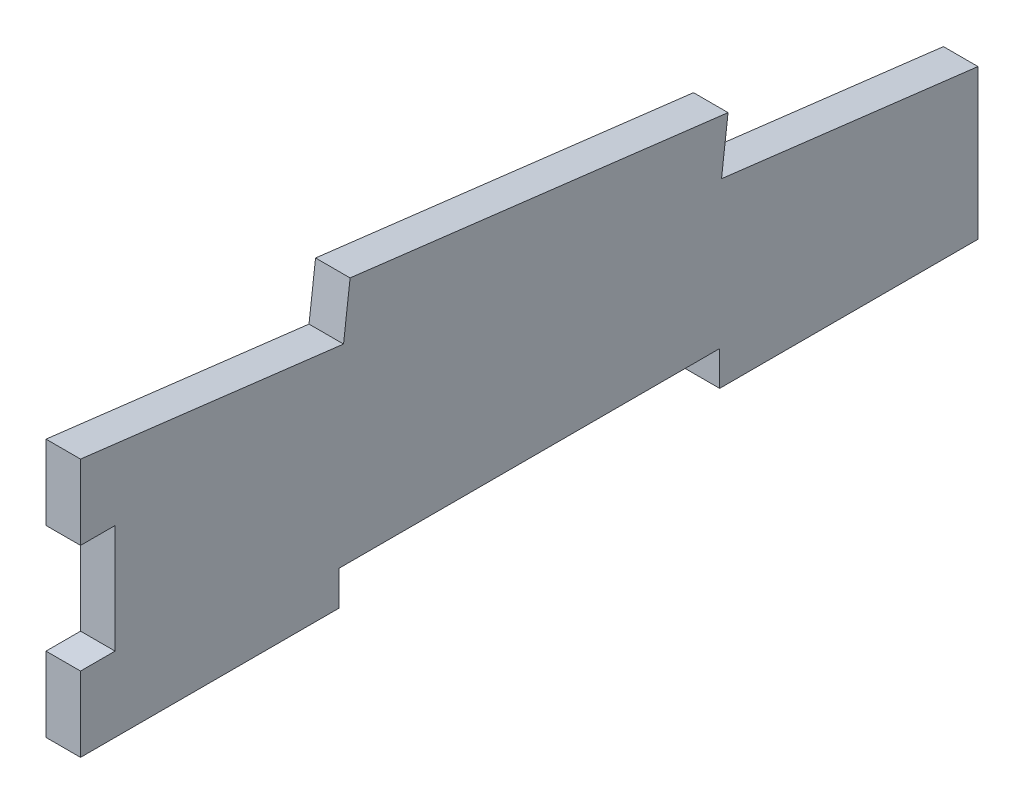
ISO-10303-21;
HEADER;
FILE_DESCRIPTION(('STEP AP214'),'2;1');
FILE_NAME('part.step','',(''),(''),'','','');
FILE_SCHEMA(('AUTOMOTIVE_DESIGN { 1 0 10303 214 1 1 1 1 }'));
ENDSEC;
DATA;
#1=APPLICATION_CONTEXT('core data for automotive mechanical design processes');
#2=APPLICATION_PROTOCOL_DEFINITION('international standard','automotive_design',2000,#1);
#3=PRODUCT_CONTEXT('',#1,'mechanical');
#4=PRODUCT('Part','Part','',(#3));
#5=PRODUCT_RELATED_PRODUCT_CATEGORY('part','',(#4));
#6=PRODUCT_DEFINITION_FORMATION('','',#4);
#7=PRODUCT_DEFINITION_CONTEXT('part definition',#1,'design');
#8=PRODUCT_DEFINITION('design','',#6,#7);
#9=PRODUCT_DEFINITION_SHAPE('','',#8);
#10=(LENGTH_UNIT() NAMED_UNIT(*) SI_UNIT(.MILLI.,.METRE.));
#11=(NAMED_UNIT(*) PLANE_ANGLE_UNIT() SI_UNIT($,.RADIAN.));
#12=(NAMED_UNIT(*) SI_UNIT($,.STERADIAN.) SOLID_ANGLE_UNIT());
#13=UNCERTAINTY_MEASURE_WITH_UNIT(LENGTH_MEASURE(1.E-05),#10,'distance_accuracy_value','');
#14=(GEOMETRIC_REPRESENTATION_CONTEXT(3) GLOBAL_UNCERTAINTY_ASSIGNED_CONTEXT((#13)) GLOBAL_UNIT_ASSIGNED_CONTEXT((#10,
#11,#12)) REPRESENTATION_CONTEXT('',''));
#15=CARTESIAN_POINT('',(0.,0.,0.));
#16=DIRECTION('',(0.,0.,1.));
#17=DIRECTION('',(1.,0.,0.));
#18=AXIS2_PLACEMENT_3D('',#15,#16,#17);
#19=CARTESIAN_POINT('',(6.35,-28.1943976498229,79.5600376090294));
#20=DIRECTION('',(0.,-0.992733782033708,0.120331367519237));
#21=DIRECTION('',(0.,-0.120331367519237,-0.992733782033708));
#22=AXIS2_PLACEMENT_3D('',#19,#20,#21);
#23=PLANE('',#22);
#24=DIRECTION('',(0.,0.120331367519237,0.992733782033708));
#25=VECTOR('',#24,1.);
#26=CARTESIAN_POINT('',(0.,-28.1943976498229,79.5600376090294));
#27=LINE('',#26,#25);
#28=CARTESIAN_POINT('',(0.,-28.1943976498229,79.5600376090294));
#29=VERTEX_POINT('',#28);
#30=CARTESIAN_POINT('',(0.,-22.3333333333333,127.913818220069));
#31=VERTEX_POINT('',#30);
#32=EDGE_CURVE('E181',#29,#31,#27,.T.);
#33=ORIENTED_EDGE('',*,*,#32,.T.);
#34=DIRECTION('',(-1.,0.,0.));
#35=VECTOR('',#34,1.);
#36=CARTESIAN_POINT('',(6.35,-22.3333333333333,127.913818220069));
#37=LINE('',#36,#35);
#38=CARTESIAN_POINT('',(6.35,-22.3333333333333,127.913818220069));
#39=VERTEX_POINT('',#38);
#40=EDGE_CURVE('E11',#39,#31,#37,.T.);
#41=ORIENTED_EDGE('',*,*,#40,.F.);
#42=DIRECTION('',(0.,0.120331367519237,0.992733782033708));
#43=VECTOR('',#42,1.);
#44=CARTESIAN_POINT('',(6.35,-28.1943976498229,79.5600376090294));
#45=LINE('',#44,#43);
#46=CARTESIAN_POINT('',(6.35,-28.1943976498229,79.5600376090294));
#47=VERTEX_POINT('',#46);
#48=EDGE_CURVE('E211',#47,#39,#45,.T.);
#49=ORIENTED_EDGE('',*,*,#48,.F.);
#50=DIRECTION('',(-1.,0.,0.));
#51=VECTOR('',#50,1.);
#52=CARTESIAN_POINT('',(6.35,-28.1943976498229,79.5600376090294));
#53=LINE('',#52,#51);
#54=EDGE_CURVE('E177',#47,#29,#53,.T.);
#55=ORIENTED_EDGE('',*,*,#54,.T.);
#56=EDGE_LOOP('',(#33,#41,#49,#55));
#57=FACE_BOUND('',#56,.T.);
#58=ADVANCED_FACE('F37',(#57),#23,.F.);
#59=CARTESIAN_POINT('',(6.35,-22.3333333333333,127.913818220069));
#60=DIRECTION('',(0.,0.,-1.));
#61=DIRECTION('',(0.,1.,0.));
#62=AXIS2_PLACEMENT_3D('',#59,#60,#61);
#63=PLANE('',#62);
#64=DIRECTION('',(0.,-1.,0.));
#65=VECTOR('',#64,1.);
#66=CARTESIAN_POINT('',(0.,-22.3333333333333,127.913818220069));
#67=LINE('',#66,#65);
#68=CARTESIAN_POINT('',(0.,-36.0833333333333,127.913818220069));
#69=VERTEX_POINT('',#68);
#70=EDGE_CURVE('E184',#31,#69,#67,.T.);
#71=ORIENTED_EDGE('',*,*,#70,.T.);
#72=DIRECTION('',(-1.,0.,0.));
#73=VECTOR('',#72,1.);
#74=CARTESIAN_POINT('',(6.35,-36.0833333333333,127.913818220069));
#75=LINE('',#74,#73);
#76=CARTESIAN_POINT('',(6.35,-36.0833333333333,127.913818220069));
#77=VERTEX_POINT('',#76);
#78=EDGE_CURVE('E45',#77,#69,#75,.T.);
#79=ORIENTED_EDGE('',*,*,#78,.F.);
#80=DIRECTION('',(0.,-1.,0.));
#81=VECTOR('',#80,1.);
#82=CARTESIAN_POINT('',(6.35,-22.3333333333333,127.913818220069));
#83=LINE('',#82,#81);
#84=EDGE_CURVE('E120',#39,#77,#83,.T.);
#85=ORIENTED_EDGE('',*,*,#84,.F.);
#86=ORIENTED_EDGE('',*,*,#40,.T.);
#87=EDGE_LOOP('',(#71,#79,#85,#86));
#88=FACE_BOUND('',#87,.T.);
#89=ADVANCED_FACE('F309',(#88),#63,.F.);
#90=CARTESIAN_POINT('',(6.35,-36.0833333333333,127.913818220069));
#91=DIRECTION('',(0.,1.,0.));
#92=DIRECTION('',(0.,0.,1.));
#93=AXIS2_PLACEMENT_3D('',#90,#91,#92);
#94=PLANE('',#93);
#95=DIRECTION('',(0.,0.,-1.));
#96=VECTOR('',#95,1.);
#97=CARTESIAN_POINT('',(0.,-36.0833333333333,127.913818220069));
#98=LINE('',#97,#96);
#99=CARTESIAN_POINT('',(0.,-36.0833333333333,121.563818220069));
#100=VERTEX_POINT('',#99);
#101=EDGE_CURVE('E186',#69,#100,#98,.T.);
#102=ORIENTED_EDGE('',*,*,#101,.T.);
#103=DIRECTION('',(-1.,0.,0.));
#104=VECTOR('',#103,1.);
#105=CARTESIAN_POINT('',(6.35,-36.0833333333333,121.563818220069));
#106=LINE('',#105,#104);
#107=CARTESIAN_POINT('',(6.35,-36.0833333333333,121.563818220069));
#108=VERTEX_POINT('',#107);
#109=EDGE_CURVE('E242',#108,#100,#106,.T.);
#110=ORIENTED_EDGE('',*,*,#109,.F.);
#111=DIRECTION('',(0.,0.,-1.));
#112=VECTOR('',#111,1.);
#113=CARTESIAN_POINT('',(6.35,-36.0833333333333,127.913818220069));
#114=LINE('',#113,#112);
#115=EDGE_CURVE('E250',#77,#108,#114,.T.);
#116=ORIENTED_EDGE('',*,*,#115,.F.);
#117=ORIENTED_EDGE('',*,*,#78,.T.);
#118=EDGE_LOOP('',(#102,#110,#116,#117));
#119=FACE_BOUND('',#118,.T.);
#120=ADVANCED_FACE('F248',(#119),#94,.F.);
#121=CARTESIAN_POINT('',(6.35,-36.0833333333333,121.563818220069));
#122=DIRECTION('',(0.,0.,-1.));
#123=DIRECTION('',(0.,1.,0.));
#124=AXIS2_PLACEMENT_3D('',#121,#122,#123);
#125=PLANE('',#124);
#126=DIRECTION('',(0.,-1.,0.));
#127=VECTOR('',#126,1.);
#128=CARTESIAN_POINT('',(0.,-36.0833333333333,121.563818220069));
#129=LINE('',#128,#127);
#130=CARTESIAN_POINT('',(0.,-56.0833333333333,121.563818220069));
#131=VERTEX_POINT('',#130);
#132=EDGE_CURVE('E188',#100,#131,#129,.T.);
#133=ORIENTED_EDGE('',*,*,#132,.T.);
#134=DIRECTION('',(-1.,0.,0.));
#135=VECTOR('',#134,1.);
#136=CARTESIAN_POINT('',(6.35,-56.0833333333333,121.563818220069));
#137=LINE('',#136,#135);
#138=CARTESIAN_POINT('',(6.35,-56.0833333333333,121.563818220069));
#139=VERTEX_POINT('',#138);
#140=EDGE_CURVE('E239',#139,#131,#137,.T.);
#141=ORIENTED_EDGE('',*,*,#140,.F.);
#142=DIRECTION('',(0.,-1.,0.));
#143=VECTOR('',#142,1.);
#144=CARTESIAN_POINT('',(6.35,-36.0833333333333,121.563818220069));
#145=LINE('',#144,#143);
#146=EDGE_CURVE('E268',#108,#139,#145,.T.);
#147=ORIENTED_EDGE('',*,*,#146,.F.);
#148=ORIENTED_EDGE('',*,*,#109,.T.);
#149=EDGE_LOOP('',(#133,#141,#147,#148));
#150=FACE_BOUND('',#149,.T.);
#151=ADVANCED_FACE('F259',(#150),#125,.F.);
#152=CARTESIAN_POINT('',(6.35,-56.0833333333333,127.913818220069));
#153=DIRECTION('',(0.,-1.,0.));
#154=DIRECTION('',(0.,0.,-1.));
#155=AXIS2_PLACEMENT_3D('',#152,#153,#154);
#156=PLANE('',#155);
#157=DIRECTION('',(0.,0.,1.));
#158=VECTOR('',#157,1.);
#159=CARTESIAN_POINT('',(0.,-56.0833333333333,127.913818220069));
#160=LINE('',#159,#158);
#161=CARTESIAN_POINT('',(0.,-56.0833333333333,127.913818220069));
#162=VERTEX_POINT('',#161);
#163=EDGE_CURVE('E190',#131,#162,#160,.T.);
#164=ORIENTED_EDGE('',*,*,#163,.T.);
#165=DIRECTION('',(-1.,0.,0.));
#166=VECTOR('',#165,1.);
#167=CARTESIAN_POINT('',(6.35,-56.0833333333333,127.913818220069));
#168=LINE('',#167,#166);
#169=CARTESIAN_POINT('',(6.35,-56.0833333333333,127.913818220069));
#170=VERTEX_POINT('',#169);
#171=EDGE_CURVE('E236',#170,#162,#168,.T.);
#172=ORIENTED_EDGE('',*,*,#171,.F.);
#173=DIRECTION('',(0.,0.,1.));
#174=VECTOR('',#173,1.);
#175=CARTESIAN_POINT('',(6.35,-56.0833333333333,127.913818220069));
#176=LINE('',#175,#174);
#177=EDGE_CURVE('E265',#139,#170,#176,.T.);
#178=ORIENTED_EDGE('',*,*,#177,.F.);
#179=ORIENTED_EDGE('',*,*,#140,.T.);
#180=EDGE_LOOP('',(#164,#172,#178,#179));
#181=FACE_BOUND('',#180,.T.);
#182=ADVANCED_FACE('F263',(#181),#156,.F.);
#183=CARTESIAN_POINT('',(6.35,-56.0833333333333,127.913818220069));
#184=DIRECTION('',(0.,0.,-1.));
#185=DIRECTION('',(-1.,0.,0.));
#186=AXIS2_PLACEMENT_3D('',#183,#184,#185);
#187=PLANE('',#186);
#188=DIRECTION('',(0.,-1.,0.));
#189=VECTOR('',#188,1.);
#190=CARTESIAN_POINT('',(0.,-56.0833333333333,127.913818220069));
#191=LINE('',#190,#189);
#192=CARTESIAN_POINT('',(0.,-69.8333333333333,127.913818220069));
#193=VERTEX_POINT('',#192);
#194=EDGE_CURVE('E192',#162,#193,#191,.T.);
#195=ORIENTED_EDGE('',*,*,#194,.T.);
#196=DIRECTION('',(-1.,0.,0.));
#197=VECTOR('',#196,1.);
#198=CARTESIAN_POINT('',(6.35,-69.8333333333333,127.913818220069));
#199=LINE('',#198,#197);
#200=CARTESIAN_POINT('',(6.35,-69.8333333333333,127.913818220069));
#201=VERTEX_POINT('',#200);
#202=EDGE_CURVE('E233',#201,#193,#199,.T.);
#203=ORIENTED_EDGE('',*,*,#202,.F.);
#204=DIRECTION('',(0.,-1.,0.));
#205=VECTOR('',#204,1.);
#206=CARTESIAN_POINT('',(6.35,-56.0833333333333,127.913818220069));
#207=LINE('',#206,#205);
#208=EDGE_CURVE('E267',#170,#201,#207,.T.);
#209=ORIENTED_EDGE('',*,*,#208,.F.);
#210=ORIENTED_EDGE('',*,*,#171,.T.);
#211=EDGE_LOOP('',(#195,#203,#209,#210));
#212=FACE_BOUND('',#211,.T.);
#213=ADVANCED_FACE('F322',(#212),#187,.F.);
#214=CARTESIAN_POINT('',(6.35,-69.8333333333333,127.913818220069));
#215=DIRECTION('',(0.,1.,0.));
#216=DIRECTION('',(0.,0.,1.));
#217=AXIS2_PLACEMENT_3D('',#214,#215,#216);
#218=PLANE('',#217);
#219=DIRECTION('',(0.,0.,-1.));
#220=VECTOR('',#219,1.);
#221=CARTESIAN_POINT('',(0.,-69.8333333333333,127.913818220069));
#222=LINE('',#221,#220);
#223=CARTESIAN_POINT('',(0.,-69.8333333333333,80.4138182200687));
#224=VERTEX_POINT('',#223);
#225=EDGE_CURVE('E194',#193,#224,#222,.T.);
#226=ORIENTED_EDGE('',*,*,#225,.T.);
#227=DIRECTION('',(-1.,0.,0.));
#228=VECTOR('',#227,1.);
#229=CARTESIAN_POINT('',(6.35,-69.8333333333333,80.4138182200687));
#230=LINE('',#229,#228);
#231=CARTESIAN_POINT('',(6.35,-69.8333333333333,80.4138182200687));
#232=VERTEX_POINT('',#231);
#233=EDGE_CURVE('E230',#232,#224,#230,.T.);
#234=ORIENTED_EDGE('',*,*,#233,.F.);
#235=DIRECTION('',(0.,0.,-1.));
#236=VECTOR('',#235,1.);
#237=CARTESIAN_POINT('',(6.35,-69.8333333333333,127.913818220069));
#238=LINE('',#237,#236);
#239=EDGE_CURVE('E270',#201,#232,#238,.T.);
#240=ORIENTED_EDGE('',*,*,#239,.F.);
#241=ORIENTED_EDGE('',*,*,#202,.T.);
#242=EDGE_LOOP('',(#226,#234,#240,#241));
#243=FACE_BOUND('',#242,.T.);
#244=ADVANCED_FACE('F325',(#243),#218,.F.);
#245=CARTESIAN_POINT('',(6.35,-69.8333333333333,80.4138182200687));
#246=DIRECTION('',(0.,0.,1.));
#247=DIRECTION('',(1.,0.,0.));
#248=AXIS2_PLACEMENT_3D('',#245,#246,#247);
#249=PLANE('',#248);
#250=DIRECTION('',(0.,1.,0.));
#251=VECTOR('',#250,1.);
#252=CARTESIAN_POINT('',(0.,-69.8333333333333,80.4138182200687));
#253=LINE('',#252,#251);
#254=CARTESIAN_POINT('',(0.,-63.4833333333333,80.4138182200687));
#255=VERTEX_POINT('',#254);
#256=EDGE_CURVE('E196',#224,#255,#253,.T.);
#257=ORIENTED_EDGE('',*,*,#256,.T.);
#258=DIRECTION('',(-1.,0.,0.));
#259=VECTOR('',#258,1.);
#260=CARTESIAN_POINT('',(6.35,-63.4833333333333,80.4138182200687));
#261=LINE('',#260,#259);
#262=CARTESIAN_POINT('',(6.35,-63.4833333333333,80.4138182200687));
#263=VERTEX_POINT('',#262);
#264=EDGE_CURVE('E227',#263,#255,#261,.T.);
#265=ORIENTED_EDGE('',*,*,#264,.F.);
#266=DIRECTION('',(0.,1.,0.));
#267=VECTOR('',#266,1.);
#268=CARTESIAN_POINT('',(6.35,-69.8333333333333,80.4138182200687));
#269=LINE('',#268,#267);
#270=EDGE_CURVE('E276',#232,#263,#269,.T.);
#271=ORIENTED_EDGE('',*,*,#270,.F.);
#272=ORIENTED_EDGE('',*,*,#233,.T.);
#273=EDGE_LOOP('',(#257,#265,#271,#272));
#274=FACE_BOUND('',#273,.T.);
#275=ADVANCED_FACE('F329',(#274),#249,.F.);
#276=CARTESIAN_POINT('',(6.35,-63.4833333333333,80.4138182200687));
#277=DIRECTION('',(0.,1.,0.));
#278=DIRECTION('',(0.,0.,1.));
#279=AXIS2_PLACEMENT_3D('',#276,#277,#278);
#280=PLANE('',#279);
#281=DIRECTION('',(0.,0.,-1.));
#282=VECTOR('',#281,1.);
#283=CARTESIAN_POINT('',(0.,-63.4833333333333,80.4138182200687));
#284=LINE('',#283,#282);
#285=CARTESIAN_POINT('',(0.,-63.4833333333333,10.4138182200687));
#286=VERTEX_POINT('',#285);
#287=EDGE_CURVE('E198',#255,#286,#284,.T.);
#288=ORIENTED_EDGE('',*,*,#287,.T.);
#289=DIRECTION('',(-1.,0.,0.));
#290=VECTOR('',#289,1.);
#291=CARTESIAN_POINT('',(6.35,-63.4833333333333,10.4138182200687));
#292=LINE('',#291,#290);
#293=CARTESIAN_POINT('',(6.35,-63.4833333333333,10.4138182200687));
#294=VERTEX_POINT('',#293);
#295=EDGE_CURVE('E224',#294,#286,#292,.T.);
#296=ORIENTED_EDGE('',*,*,#295,.F.);
#297=DIRECTION('',(0.,0.,-1.));
#298=VECTOR('',#297,1.);
#299=CARTESIAN_POINT('',(6.35,-63.4833333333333,80.4138182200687));
#300=LINE('',#299,#298);
#301=EDGE_CURVE('E278',#263,#294,#300,.T.);
#302=ORIENTED_EDGE('',*,*,#301,.F.);
#303=ORIENTED_EDGE('',*,*,#264,.T.);
#304=EDGE_LOOP('',(#288,#296,#302,#303));
#305=FACE_BOUND('',#304,.T.);
#306=ADVANCED_FACE('F333',(#305),#280,.F.);
#307=CARTESIAN_POINT('',(6.35,-69.8333333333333,10.4138182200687));
#308=DIRECTION('',(0.,0.,-1.));
#309=DIRECTION('',(-1.,0.,0.));
#310=AXIS2_PLACEMENT_3D('',#307,#308,#309);
#311=PLANE('',#310);
#312=DIRECTION('',(0.,-1.,0.));
#313=VECTOR('',#312,1.);
#314=CARTESIAN_POINT('',(0.,-69.8333333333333,10.4138182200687));
#315=LINE('',#314,#313);
#316=CARTESIAN_POINT('',(0.,-69.8333333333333,10.4138182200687));
#317=VERTEX_POINT('',#316);
#318=EDGE_CURVE('E200',#286,#317,#315,.T.);
#319=ORIENTED_EDGE('',*,*,#318,.T.);
#320=DIRECTION('',(-1.,0.,0.));
#321=VECTOR('',#320,1.);
#322=CARTESIAN_POINT('',(6.35,-69.8333333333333,10.4138182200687));
#323=LINE('',#322,#321);
#324=CARTESIAN_POINT('',(6.35,-69.8333333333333,10.4138182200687));
#325=VERTEX_POINT('',#324);
#326=EDGE_CURVE('E221',#325,#317,#323,.T.);
#327=ORIENTED_EDGE('',*,*,#326,.F.);
#328=DIRECTION('',(0.,-1.,0.));
#329=VECTOR('',#328,1.);
#330=CARTESIAN_POINT('',(6.35,-69.8333333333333,10.4138182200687));
#331=LINE('',#330,#329);
#332=EDGE_CURVE('E280',#294,#325,#331,.T.);
#333=ORIENTED_EDGE('',*,*,#332,.F.);
#334=ORIENTED_EDGE('',*,*,#295,.T.);
#335=EDGE_LOOP('',(#319,#327,#333,#334));
#336=FACE_BOUND('',#335,.T.);
#337=ADVANCED_FACE('F337',(#336),#311,.F.);
#338=CARTESIAN_POINT('',(6.35,-69.8333333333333,10.4138182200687));
#339=DIRECTION('',(0.,1.,0.));
#340=DIRECTION('',(0.,0.,1.));
#341=AXIS2_PLACEMENT_3D('',#338,#339,#340);
#342=PLANE('',#341);
#343=DIRECTION('',(0.,0.,-1.));
#344=VECTOR('',#343,1.);
#345=CARTESIAN_POINT('',(0.,-69.8333333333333,10.4138182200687));
#346=LINE('',#345,#344);
#347=CARTESIAN_POINT('',(0.,-69.8333333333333,-37.0861817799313));
#348=VERTEX_POINT('',#347);
#349=EDGE_CURVE('E202',#317,#348,#346,.T.);
#350=ORIENTED_EDGE('',*,*,#349,.T.);
#351=DIRECTION('',(-1.,0.,0.));
#352=VECTOR('',#351,1.);
#353=CARTESIAN_POINT('',(6.35,-69.8333333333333,-37.0861817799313));
#354=LINE('',#353,#352);
#355=CARTESIAN_POINT('',(6.35,-69.8333333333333,-37.0861817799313));
#356=VERTEX_POINT('',#355);
#357=EDGE_CURVE('E218',#356,#348,#354,.T.);
#358=ORIENTED_EDGE('',*,*,#357,.F.);
#359=DIRECTION('',(0.,0.,-1.));
#360=VECTOR('',#359,1.);
#361=CARTESIAN_POINT('',(6.35,-69.8333333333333,10.4138182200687));
#362=LINE('',#361,#360);
#363=EDGE_CURVE('E282',#325,#356,#362,.T.);
#364=ORIENTED_EDGE('',*,*,#363,.F.);
#365=ORIENTED_EDGE('',*,*,#326,.T.);
#366=EDGE_LOOP('',(#350,#358,#364,#365));
#367=FACE_BOUND('',#366,.T.);
#368=ADVANCED_FACE('F341',(#367),#342,.F.);
#369=CARTESIAN_POINT('',(6.35,-69.8333333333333,-37.0861817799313));
#370=DIRECTION('',(0.,0.,1.));
#371=DIRECTION('',(1.,0.,0.));
#372=AXIS2_PLACEMENT_3D('',#369,#370,#371);
#373=PLANE('',#372);
#374=DIRECTION('',(0.,1.,0.));
#375=VECTOR('',#374,1.);
#376=CARTESIAN_POINT('',(0.,-69.8333333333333,-37.0861817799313));
#377=LINE('',#376,#375);
#378=CARTESIAN_POINT('',(0.,-42.3333333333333,-37.0861817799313));
#379=VERTEX_POINT('',#378);
#380=EDGE_CURVE('E204',#348,#379,#377,.T.);
#381=ORIENTED_EDGE('',*,*,#380,.T.);
#382=DIRECTION('',(-1.,0.,0.));
#383=VECTOR('',#382,1.);
#384=CARTESIAN_POINT('',(6.35,-42.3333333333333,-37.0861817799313));
#385=LINE('',#384,#383);
#386=CARTESIAN_POINT('',(6.35,-42.3333333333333,-37.0861817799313));
#387=VERTEX_POINT('',#386);
#388=EDGE_CURVE('E215',#387,#379,#385,.T.);
#389=ORIENTED_EDGE('',*,*,#388,.F.);
#390=DIRECTION('',(0.,1.,0.));
#391=VECTOR('',#390,1.);
#392=CARTESIAN_POINT('',(6.35,-69.8333333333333,-37.0861817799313));
#393=LINE('',#392,#391);
#394=EDGE_CURVE('E284',#356,#387,#393,.T.);
#395=ORIENTED_EDGE('',*,*,#394,.F.);
#396=ORIENTED_EDGE('',*,*,#357,.T.);
#397=EDGE_LOOP('',(#381,#389,#395,#396));
#398=FACE_BOUND('',#397,.T.);
#399=ADVANCED_FACE('F290',(#398),#373,.F.);
#400=CARTESIAN_POINT('',(6.35,-42.3333333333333,-37.0861817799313));
#401=DIRECTION('',(0.,-0.992733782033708,0.120331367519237));
#402=DIRECTION('',(0.,-0.120331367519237,-0.992733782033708));
#403=AXIS2_PLACEMENT_3D('',#400,#401,#402);
#404=PLANE('',#403);
#405=DIRECTION('',(0.,0.120331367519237,0.992733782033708));
#406=VECTOR('',#405,1.);
#407=CARTESIAN_POINT('',(0.,-42.3333333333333,-37.0861817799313));
#408=LINE('',#407,#406);
#409=CARTESIAN_POINT('',(0.,-36.6175933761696,10.0686728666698));
#410=VERTEX_POINT('',#409);
#411=EDGE_CURVE('E206',#379,#410,#408,.T.);
#412=ORIENTED_EDGE('',*,*,#411,.T.);
#413=DIRECTION('',(-1.,0.,0.));
#414=VECTOR('',#413,1.);
#415=CARTESIAN_POINT('',(6.35,-36.6175933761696,10.0686728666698));
#416=LINE('',#415,#414);
#417=CARTESIAN_POINT('',(6.35,-36.6175933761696,10.0686728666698));
#418=VERTEX_POINT('',#417);
#419=EDGE_CURVE('E172',#418,#410,#416,.T.);
#420=ORIENTED_EDGE('',*,*,#419,.F.);
#421=DIRECTION('',(0.,0.120331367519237,0.992733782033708));
#422=VECTOR('',#421,1.);
#423=CARTESIAN_POINT('',(6.35,-42.3333333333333,-37.0861817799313));
#424=LINE('',#423,#422);
#425=EDGE_CURVE('E163',#387,#418,#424,.T.);
#426=ORIENTED_EDGE('',*,*,#425,.F.);
#427=ORIENTED_EDGE('',*,*,#388,.T.);
#428=EDGE_LOOP('',(#412,#420,#426,#427));
#429=FACE_BOUND('',#428,.T.);
#430=ADVANCED_FACE('F294',(#429),#404,.F.);
#431=CARTESIAN_POINT('',(6.35,-36.6175933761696,10.0686728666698));
#432=DIRECTION('',(0.,0.120331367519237,0.992733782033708));
#433=DIRECTION('',(0.,-0.992733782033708,0.120331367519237));
#434=AXIS2_PLACEMENT_3D('',#431,#432,#433);
#435=PLANE('',#434);
#436=DIRECTION('',(0.,0.992733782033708,-0.120331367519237));
#437=VECTOR('',#436,1.);
#438=CARTESIAN_POINT('',(0.,-36.6175933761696,10.0686728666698));
#439=LINE('',#438,#437);
#440=CARTESIAN_POINT('',(0.,-26.6902555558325,8.86535919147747));
#441=VERTEX_POINT('',#440);
#442=EDGE_CURVE('E171',#410,#441,#439,.T.);
#443=ORIENTED_EDGE('',*,*,#442,.T.);
#444=DIRECTION('',(-1.,0.,0.));
#445=VECTOR('',#444,1.);
#446=CARTESIAN_POINT('',(6.35,-26.6902555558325,8.86535919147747));
#447=LINE('',#446,#445);
#448=CARTESIAN_POINT('',(6.35,-26.6902555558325,8.86535919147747));
#449=VERTEX_POINT('',#448);
#450=EDGE_CURVE('E168',#449,#441,#447,.T.);
#451=ORIENTED_EDGE('',*,*,#450,.F.);
#452=DIRECTION('',(0.,0.992733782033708,-0.120331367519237));
#453=VECTOR('',#452,1.);
#454=CARTESIAN_POINT('',(6.35,-36.6175933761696,10.0686728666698));
#455=LINE('',#454,#453);
#456=EDGE_CURVE('E157',#418,#449,#455,.T.);
#457=ORIENTED_EDGE('',*,*,#456,.F.);
#458=ORIENTED_EDGE('',*,*,#419,.T.);
#459=EDGE_LOOP('',(#443,#451,#457,#458));
#460=FACE_BOUND('',#459,.T.);
#461=ADVANCED_FACE('F169',(#460),#435,.F.);
#462=CARTESIAN_POINT('',(6.35,-18.2670598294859,78.356723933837));
#463=DIRECTION('',(0.,-0.992733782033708,0.120331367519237));
#464=DIRECTION('',(0.,-0.120331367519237,-0.992733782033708));
#465=AXIS2_PLACEMENT_3D('',#462,#463,#464);
#466=PLANE('',#465);
#467=DIRECTION('',(0.,0.120331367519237,0.992733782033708));
#468=VECTOR('',#467,1.);
#469=CARTESIAN_POINT('',(0.,-18.2670598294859,78.356723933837));
#470=LINE('',#469,#468);
#471=CARTESIAN_POINT('',(0.,-18.2670598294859,78.356723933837));
#472=VERTEX_POINT('',#471);
#473=EDGE_CURVE('E106',#441,#472,#470,.T.);
#474=ORIENTED_EDGE('',*,*,#473,.T.);
#475=DIRECTION('',(-1.,0.,0.));
#476=VECTOR('',#475,1.);
#477=CARTESIAN_POINT('',(6.35,-18.2670598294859,78.356723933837));
#478=LINE('',#477,#476);
#479=CARTESIAN_POINT('',(6.35,-18.2670598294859,78.356723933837));
#480=VERTEX_POINT('',#479);
#481=EDGE_CURVE('E173',#480,#472,#478,.T.);
#482=ORIENTED_EDGE('',*,*,#481,.F.);
#483=DIRECTION('',(0.,0.120331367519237,0.992733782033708));
#484=VECTOR('',#483,1.);
#485=CARTESIAN_POINT('',(6.35,-18.2670598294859,78.356723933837));
#486=LINE('',#485,#484);
#487=EDGE_CURVE('E161',#449,#480,#486,.T.);
#488=ORIENTED_EDGE('',*,*,#487,.F.);
#489=ORIENTED_EDGE('',*,*,#450,.T.);
#490=EDGE_LOOP('',(#474,#482,#488,#489));
#491=FACE_BOUND('',#490,.T.);
#492=ADVANCED_FACE('F175',(#491),#466,.F.);
#493=CARTESIAN_POINT('',(6.35,-28.1943976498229,79.5600376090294));
#494=DIRECTION('',(0.,-0.120331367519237,-0.992733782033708));
#495=DIRECTION('',(0.,0.992733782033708,-0.120331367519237));
#496=AXIS2_PLACEMENT_3D('',#493,#494,#495);
#497=PLANE('',#496);
#498=DIRECTION('',(0.,-0.992733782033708,0.120331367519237));
#499=VECTOR('',#498,1.);
#500=CARTESIAN_POINT('',(0.,-28.1943976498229,79.5600376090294));
#501=LINE('',#500,#499);
#502=EDGE_CURVE('E112',#472,#29,#501,.T.);
#503=ORIENTED_EDGE('',*,*,#502,.T.);
#504=ORIENTED_EDGE('',*,*,#54,.F.);
#505=DIRECTION('',(0.,-0.992733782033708,0.120331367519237));
#506=VECTOR('',#505,1.);
#507=CARTESIAN_POINT('',(6.35,-28.1943976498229,79.5600376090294));
#508=LINE('',#507,#506);
#509=EDGE_CURVE('E53',#480,#47,#508,.T.);
#510=ORIENTED_EDGE('',*,*,#509,.F.);
#511=ORIENTED_EDGE('',*,*,#481,.T.);
#512=EDGE_LOOP('',(#503,#504,#510,#511));
#513=FACE_BOUND('',#512,.T.);
#514=ADVANCED_FACE('F298',(#513),#497,.F.);
#515=CARTESIAN_POINT('',(6.35,0.,0.));
#516=DIRECTION('',(-1.,0.,0.));
#517=DIRECTION('',(0.,0.,1.));
#518=AXIS2_PLACEMENT_3D('',#515,#516,#517);
#519=PLANE('',#518);
#520=ORIENTED_EDGE('',*,*,#48,.T.);
#521=ORIENTED_EDGE('',*,*,#84,.T.);
#522=ORIENTED_EDGE('',*,*,#115,.T.);
#523=ORIENTED_EDGE('',*,*,#146,.T.);
#524=ORIENTED_EDGE('',*,*,#177,.T.);
#525=ORIENTED_EDGE('',*,*,#208,.T.);
#526=ORIENTED_EDGE('',*,*,#239,.T.);
#527=ORIENTED_EDGE('',*,*,#270,.T.);
#528=ORIENTED_EDGE('',*,*,#301,.T.);
#529=ORIENTED_EDGE('',*,*,#332,.T.);
#530=ORIENTED_EDGE('',*,*,#363,.T.);
#531=ORIENTED_EDGE('',*,*,#394,.T.);
#532=ORIENTED_EDGE('',*,*,#425,.T.);
#533=ORIENTED_EDGE('',*,*,#456,.T.);
#534=ORIENTED_EDGE('',*,*,#487,.T.);
#535=ORIENTED_EDGE('',*,*,#509,.T.);
#536=EDGE_LOOP('',(#520,#521,#522,#523,#524,#525,#526,#527,#528,#529,#530,#531,#532,#533,#534,#535));
#537=FACE_BOUND('',#536,.T.);
#538=ADVANCED_FACE('F159',(#537),#519,.F.);
#539=CARTESIAN_POINT('',(0.,0.,0.));
#540=DIRECTION('',(-1.,0.,0.));
#541=DIRECTION('',(0.,0.,1.));
#542=AXIS2_PLACEMENT_3D('',#539,#540,#541);
#543=PLANE('',#542);
#544=ORIENTED_EDGE('',*,*,#32,.F.);
#545=ORIENTED_EDGE('',*,*,#502,.F.);
#546=ORIENTED_EDGE('',*,*,#473,.F.);
#547=ORIENTED_EDGE('',*,*,#442,.F.);
#548=ORIENTED_EDGE('',*,*,#411,.F.);
#549=ORIENTED_EDGE('',*,*,#380,.F.);
#550=ORIENTED_EDGE('',*,*,#349,.F.);
#551=ORIENTED_EDGE('',*,*,#318,.F.);
#552=ORIENTED_EDGE('',*,*,#287,.F.);
#553=ORIENTED_EDGE('',*,*,#256,.F.);
#554=ORIENTED_EDGE('',*,*,#225,.F.);
#555=ORIENTED_EDGE('',*,*,#194,.F.);
#556=ORIENTED_EDGE('',*,*,#163,.F.);
#557=ORIENTED_EDGE('',*,*,#132,.F.);
#558=ORIENTED_EDGE('',*,*,#101,.F.);
#559=ORIENTED_EDGE('',*,*,#70,.F.);
#560=EDGE_LOOP('',(#544,#545,#546,#547,#548,#549,#550,#551,#552,#553,#554,#555,#556,#557,#558,#559));
#561=FACE_BOUND('',#560,.T.);
#562=ADVANCED_FACE('F254',(#561),#543,.T.);
#563=CLOSED_SHELL('',(#58,#89,#120,#151,#182,#213,#244,#275,#306,#337,#368,#399,#430,#461,#492,
#514,#538,#562));
#564=MANIFOLD_SOLID_BREP('B2',#563);
#565=ADVANCED_BREP_SHAPE_REPRESENTATION('',(#18,#564),#14);
#566=SHAPE_DEFINITION_REPRESENTATION(#9,#565);
ENDSEC;
END-ISO-10303-21;
